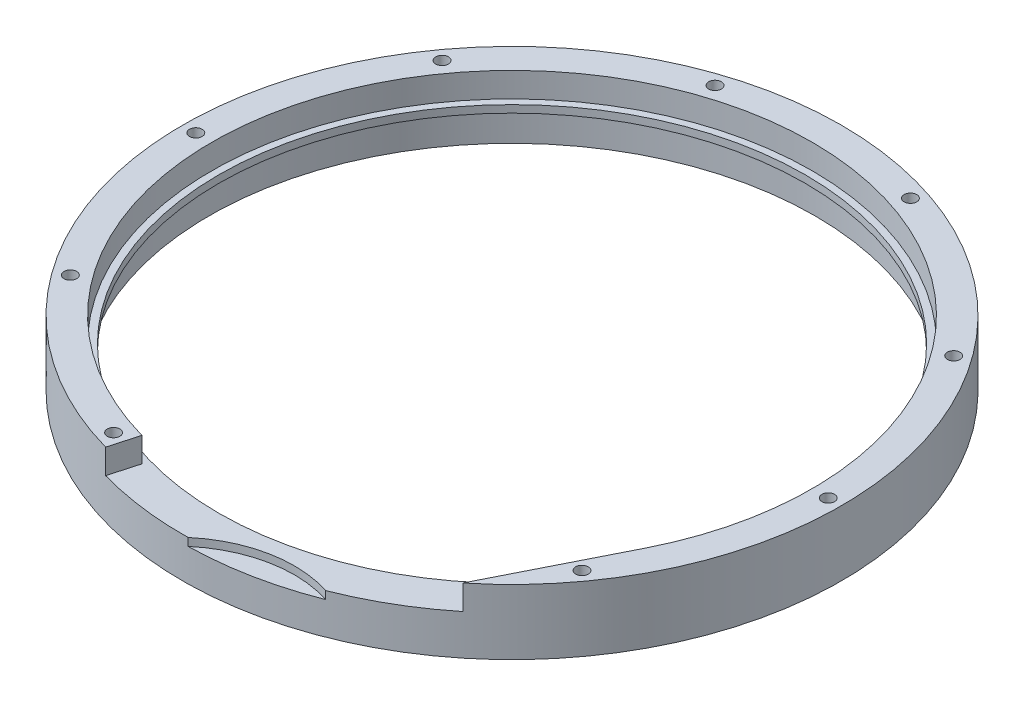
from build123d import *

# Parameters (mm, degrees)
SKETCH2_R                    = 126.363088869
CUT_EXTRUDE1_DEPTH           = 122.173678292
SKETCH6_W                    = 1.7888
SKETCH6_H                    = 6.366999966
CUT_EXTRUDE3_REACH           = 123.174
SKETCH7_R                    = 78
CUT_EXTRUDE2_START           = -6.366999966
CUT_EXTRUDE2_DEPTH           = 6.366999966
SKETCH8_R                    = 30.906768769
CUT_EXTRUDE4_DEPTH           = 2
F_30_0_1285_DIAMETER_HOLE1_D = 3.2639
CIRPATTERN1_COUNT            = 10


with BuildPart() as part:
    # Sketch1 → Revolve1 (revolve)
    with BuildSketch(Plane.XY, mode=Mode.PRIVATE) as revolve1_sk:
        Polygon((84.858, 0), (84.858, -19.700999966), (75.5, -19.700999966), (75.5, -16.271999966), (78, -16.271999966), (78, -8.271999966), (75.5, -8.271999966), (75.5, 0), align=None)
    revolve(revolve1_sk.sketch.rotate(Axis((0, 0, 0), (0, -1, 0)), 90), axis=Axis((0, 0, 0), (0, -1, 0)))

    # Sketch2 → Cut-Extrude1 (cut, through all)
    with BuildSketch(Plane.XZ.offset(16.771999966)):
        Circle(SKETCH2_R)
    extrude(amount=CUT_EXTRUDE1_DEPTH, mode=Mode.SUBTRACT)

    # Sketch6 → Cut-Revolve1 (revolve, cut)
    with BuildSketch(Plane.XY, mode=Mode.PRIVATE) as cut_revolve1_sk:
        with Locations((76.3944, -3.183499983)):
            Rectangle(SKETCH6_W, SKETCH6_H)
    revolve(cut_revolve1_sk.sketch.rotate(Axis((0, 0, 0), (0, -1, 0)), 90), axis=Axis((0, 0, 0), (0, -1, 0)), mode=Mode.SUBTRACT)

    # Sketch7 → Cut-Extrude3 (cut, up to next)
    with BuildSketch(Plane.XZ.offset(16.771999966), mode=Mode.PRIVATE) as cut_extrude3_sk1:
        with Locations(Location((0, 0, 0), (0, 0, 90))):
            Circle(SKETCH7_R)
    cut_extrude3_tool1 = extrude(cut_extrude3_sk1.sketch, amount=-CUT_EXTRUDE3_REACH, mode=Mode.PRIVATE) & part.part
    add(cut_extrude3_tool1.solids().sort_by_distance((0, -16.772, 0))[0], mode=Mode.SUBTRACT)

    # Sketch3 → Cut-Extrude2 (cut)
    with BuildSketch(Plane(origin=(0, 0, 0), x_dir=(-1, 0, 0), z_dir=(0, 1, 0)).offset(CUT_EXTRUDE2_START)):
        with BuildLine():
            Line((-53.330005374, 66.00598981), (-69.059940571, 34.702783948))
            Line((-69.059940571, 34.702783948), (0, 0))
            Line((0, 0), (22.962612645, 81.692096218))
            ThreePointArc((22.962612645, 81.692096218), (-17.08970798, 83.119324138), (-53.330005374, 66.00598981))
        make_face()
    extrude(amount=CUT_EXTRUDE2_DEPTH, mode=Mode.SUBTRACT)

    # Sketch8 → Cut-Extrude4 (cut)
    with BuildSketch(Plane(origin=(0, -6.366999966, 0), x_dir=(-1, 0, 0), z_dir=(0, 1, 0))):
        with Locations((-21.469456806, 108.394245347)):
            Circle(SKETCH8_R)
    extrude(amount=-CUT_EXTRUDE4_DEPTH, mode=Mode.SUBTRACT)

    # 30 _0.1285_ Diameter Hole1 (through all)
    with Locations(Plane.XZ.offset(16.771999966)):
        with Locations((81.429, 0)):
            f_30_0_1285_diameter_hole1 = Hole(F_30_0_1285_DIAMETER_HOLE1_D / 2)

    # CirPattern1: 30 _0.1285_ Diameter Hole1 ×10 about axis, 1 skipped
    cirpattern1_axis = Axis((0, 0, 0), (0, -1, 0))
    add([f_30_0_1285_diameter_hole1.rotate(cirpattern1_axis, i * 360 / CIRPATTERN1_COUNT) for i in range(1, CIRPATTERN1_COUNT) if i not in (2,)], mode=Mode.SUBTRACT)


solid = part.part
